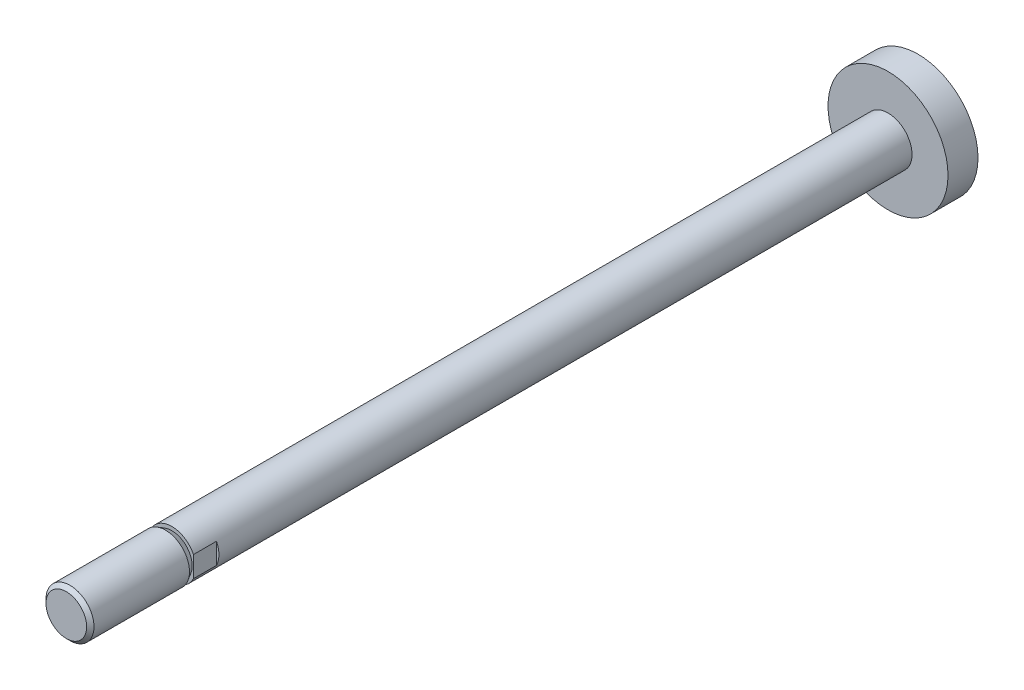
ISO-10303-21;
HEADER;
FILE_DESCRIPTION(('STEP AP214'),'2;1');
FILE_NAME('part.step','',(''),(''),'','','');
FILE_SCHEMA(('AUTOMOTIVE_DESIGN { 1 0 10303 214 1 1 1 1 }'));
ENDSEC;
DATA;
#1=APPLICATION_CONTEXT('core data for automotive mechanical design processes');
#2=APPLICATION_PROTOCOL_DEFINITION('international standard','automotive_design',2000,#1);
#3=PRODUCT_CONTEXT('',#1,'mechanical');
#4=PRODUCT('Part','Part','',(#3));
#5=PRODUCT_RELATED_PRODUCT_CATEGORY('part','',(#4));
#6=PRODUCT_DEFINITION_FORMATION('','',#4);
#7=PRODUCT_DEFINITION_CONTEXT('part definition',#1,'design');
#8=PRODUCT_DEFINITION('design','',#6,#7);
#9=PRODUCT_DEFINITION_SHAPE('','',#8);
#10=(LENGTH_UNIT() NAMED_UNIT(*) SI_UNIT(.MILLI.,.METRE.));
#11=(NAMED_UNIT(*) PLANE_ANGLE_UNIT() SI_UNIT($,.RADIAN.));
#12=(NAMED_UNIT(*) SI_UNIT($,.STERADIAN.) SOLID_ANGLE_UNIT());
#13=UNCERTAINTY_MEASURE_WITH_UNIT(LENGTH_MEASURE(1.E-05),#10,'distance_accuracy_value','');
#14=(GEOMETRIC_REPRESENTATION_CONTEXT(3) GLOBAL_UNCERTAINTY_ASSIGNED_CONTEXT((#13)) GLOBAL_UNIT_ASSIGNED_CONTEXT((#10,
#11,#12)) REPRESENTATION_CONTEXT('',''));
#15=CARTESIAN_POINT('',(0.,0.,0.));
#16=DIRECTION('',(0.,0.,1.));
#17=DIRECTION('',(1.,0.,0.));
#18=AXIS2_PLACEMENT_3D('',#15,#16,#17);
#19=CARTESIAN_POINT('',(0.,2.1165,50.));
#20=DIRECTION('',(0.,0.,1.));
#21=DIRECTION('',(1.,0.,0.));
#22=AXIS2_PLACEMENT_3D('',#19,#20,#21);
#23=PLANE('',#22);
#24=CARTESIAN_POINT('',(0.,0.,49.9999999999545));
#25=DIRECTION('',(0.,0.,-1.));
#26=DIRECTION('',(-1.,0.,0.));
#27=AXIS2_PLACEMENT_3D('',#24,#25,#26);
#28=CIRCLE('',#27,4.23300000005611);
#29=CARTESIAN_POINT('',(-4.23300000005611,0.,49.9999999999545));
#30=VERTEX_POINT('',#29);
#31=EDGE_CURVE('E21',#30,#30,#28,.T.);
#32=ORIENTED_EDGE('',*,*,#31,.F.);
#33=EDGE_LOOP('',(#32));
#34=FACE_BOUND('',#33,.T.);
#35=ADVANCED_FACE('F17',(#34),#23,.T.);
#36=CARTESIAN_POINT('',(0.,0.,49.2330000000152));
#37=DIRECTION('',(0.,0.,-1.));
#38=DIRECTION('',(-1.,0.,0.));
#39=AXIS2_PLACEMENT_3D('',#36,#37,#38);
#40=CONICAL_SURFACE('',#39,4.99999999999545,0.785398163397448);
#41=ORIENTED_EDGE('',*,*,#31,.T.);
#42=EDGE_LOOP('',(#41));
#43=FACE_BOUND('',#42,.T.);
#44=CARTESIAN_POINT('',(0.,0.,49.233));
#45=DIRECTION('',(0.,0.,1.));
#46=DIRECTION('',(1.,0.,0.));
#47=AXIS2_PLACEMENT_3D('',#44,#45,#46);
#48=CIRCLE('',#47,5.);
#49=CARTESIAN_POINT('',(5.,0.,49.233));
#50=VERTEX_POINT('',#49);
#51=EDGE_CURVE('E104',#50,#50,#48,.F.);
#52=ORIENTED_EDGE('',*,*,#51,.F.);
#53=EDGE_LOOP('',(#52));
#54=FACE_BOUND('',#53,.T.);
#55=ADVANCED_FACE('F197',(#43,#54),#40,.T.);
#56=CARTESIAN_POINT('',(0.,0.,39.2807414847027));
#57=DIRECTION('',(0.,0.,1.));
#58=DIRECTION('',(1.,0.,0.));
#59=AXIS2_PLACEMENT_3D('',#56,#57,#58);
#60=CYLINDRICAL_SURFACE('',#59,5.);
#61=ORIENTED_EDGE('',*,*,#51,.T.);
#62=EDGE_LOOP('',(#61));
#63=FACE_BOUND('',#62,.T.);
#64=CARTESIAN_POINT('',(0.,0.,29.328482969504));
#65=DIRECTION('',(0.,0.,1.));
#66=DIRECTION('',(0.,1.,0.));
#67=AXIS2_PLACEMENT_3D('',#64,#65,#66);
#68=CIRCLE('',#67,4.99999999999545);
#69=CARTESIAN_POINT('',(0.,4.99999999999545,29.328482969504));
#70=VERTEX_POINT('',#69);
#71=EDGE_CURVE('E64',#70,#70,#68,.F.);
#72=ORIENTED_EDGE('',*,*,#71,.F.);
#73=EDGE_LOOP('',(#72));
#74=FACE_BOUND('',#73,.T.);
#75=ADVANCED_FACE('F189',(#63,#74),#60,.T.);
#76=CARTESIAN_POINT('',(0.,6.25,-127.5));
#77=DIRECTION('',(0.,0.,-1.));
#78=DIRECTION('',(-1.,0.,0.));
#79=AXIS2_PLACEMENT_3D('',#76,#77,#78);
#80=PLANE('',#79);
#81=CARTESIAN_POINT('',(0.,0.,-127.5));
#82=DIRECTION('',(0.,0.,1.));
#83=DIRECTION('',(1.,0.,0.));
#84=AXIS2_PLACEMENT_3D('',#81,#82,#83);
#85=CIRCLE('',#84,12.5);
#86=CARTESIAN_POINT('',(12.5,0.,-127.5));
#87=VERTEX_POINT('',#86);
#88=EDGE_CURVE('E63',#87,#87,#85,.T.);
#89=ORIENTED_EDGE('',*,*,#88,.F.);
#90=EDGE_LOOP('',(#89));
#91=FACE_BOUND('',#90,.T.);
#92=ADVANCED_FACE('F181',(#91),#80,.T.);
#93=CARTESIAN_POINT('',(0.,0.,29.3284829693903));
#94=DIRECTION('',(0.,0.,1.));
#95=DIRECTION('',(1.,0.,0.));
#96=AXIS2_PLACEMENT_3D('',#93,#94,#95);
#97=CONICAL_SURFACE('',#96,4.99999999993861,0.523598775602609);
#98=ORIENTED_EDGE('',*,*,#71,.T.);
#99=EDGE_LOOP('',(#98));
#100=FACE_BOUND('',#99,.T.);
#101=CARTESIAN_POINT('',(0.,0.,27.9999999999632));
#102=DIRECTION('',(0.,0.,1.));
#103=DIRECTION('',(1.,0.,0.));
#104=AXIS2_PLACEMENT_3D('',#101,#102,#103);
#105=CIRCLE('',#104,4.2329999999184);
#106=CARTESIAN_POINT('',(4.2329999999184,0.,27.9999999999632));
#107=VERTEX_POINT('',#106);
#108=EDGE_CURVE('E80',#107,#107,#105,.F.);
#109=ORIENTED_EDGE('',*,*,#108,.F.);
#110=EDGE_LOOP('',(#109));
#111=FACE_BOUND('',#110,.T.);
#112=ADVANCED_FACE('F174',(#100,#111),#97,.T.);
#113=CARTESIAN_POINT('',(-4.5,22.,23.2));
#114=DIRECTION('',(0.,0.,-1.));
#115=DIRECTION('',(-1.,0.,0.));
#116=AXIS2_PLACEMENT_3D('',#113,#114,#115);
#117=PLANE('',#116);
#118=DIRECTION('',(0.,1.,0.));
#119=VECTOR('',#118,1.);
#120=CARTESIAN_POINT('',(-4.5,22.,23.2));
#121=LINE('',#120,#119);
#122=CARTESIAN_POINT('',(-4.5,-2.17944947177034,23.2));
#123=VERTEX_POINT('',#122);
#124=CARTESIAN_POINT('',(-4.5,2.17944947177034,23.2));
#125=VERTEX_POINT('',#124);
#126=EDGE_CURVE('E55',#123,#125,#121,.T.);
#127=ORIENTED_EDGE('',*,*,#126,.T.);
#128=CARTESIAN_POINT('',(0.,0.,23.2));
#129=DIRECTION('',(0.,0.,1.));
#130=DIRECTION('',(1.,0.,0.));
#131=AXIS2_PLACEMENT_3D('',#128,#129,#130);
#132=CIRCLE('',#131,5.);
#133=EDGE_CURVE('E59',#123,#125,#132,.F.);
#134=ORIENTED_EDGE('',*,*,#133,.F.);
#135=EDGE_LOOP('',(#127,#134));
#136=FACE_BOUND('',#135,.T.);
#137=ADVANCED_FACE('F57',(#136),#117,.F.);
#138=CARTESIAN_POINT('',(-4.5,22.,28.));
#139=DIRECTION('',(1.,0.,0.));
#140=DIRECTION('',(0.,0.,-1.));
#141=AXIS2_PLACEMENT_3D('',#138,#139,#140);
#142=PLANE('',#141);
#143=DIRECTION('',(0.,1.,0.));
#144=VECTOR('',#143,1.);
#145=CARTESIAN_POINT('',(-4.5,4.6165,28.));
#146=LINE('',#145,#144);
#147=CARTESIAN_POINT('',(-4.5,2.17944947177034,28.));
#148=VERTEX_POINT('',#147);
#149=CARTESIAN_POINT('',(-4.5,-2.17944947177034,28.));
#150=VERTEX_POINT('',#149);
#151=EDGE_CURVE('E71',#148,#150,#146,.F.);
#152=ORIENTED_EDGE('',*,*,#151,.F.);
#153=DIRECTION('',(0.,0.,1.));
#154=VECTOR('',#153,1.);
#155=CARTESIAN_POINT('',(-4.5,2.17944947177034,-46.625));
#156=LINE('',#155,#154);
#157=EDGE_CURVE('E68',#125,#148,#156,.T.);
#158=ORIENTED_EDGE('',*,*,#157,.F.);
#159=ORIENTED_EDGE('',*,*,#126,.F.);
#160=DIRECTION('',(0.,0.,1.));
#161=VECTOR('',#160,1.);
#162=CARTESIAN_POINT('',(-4.5,-2.17944947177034,-46.625));
#163=LINE('',#162,#161);
#164=EDGE_CURVE('E78',#150,#123,#163,.F.);
#165=ORIENTED_EDGE('',*,*,#164,.F.);
#166=EDGE_LOOP('',(#152,#158,#159,#165));
#167=FACE_BOUND('',#166,.T.);
#168=ADVANCED_FACE('F69',(#167),#142,.F.);
#169=CARTESIAN_POINT('',(0.,0.,-124.375));
#170=DIRECTION('',(0.,0.,1.));
#171=DIRECTION('',(1.,0.,0.));
#172=AXIS2_PLACEMENT_3D('',#169,#170,#171);
#173=CYLINDRICAL_SURFACE('',#172,12.5);
#174=CARTESIAN_POINT('',(0.,0.,-121.25));
#175=DIRECTION('',(0.,0.,1.));
#176=DIRECTION('',(1.,0.,0.));
#177=AXIS2_PLACEMENT_3D('',#174,#175,#176);
#178=CIRCLE('',#177,12.5);
#179=CARTESIAN_POINT('',(12.5,0.,-121.25));
#180=VERTEX_POINT('',#179);
#181=EDGE_CURVE('E74',#180,#180,#178,.T.);
#182=ORIENTED_EDGE('',*,*,#181,.F.);
#183=EDGE_LOOP('',(#182));
#184=FACE_BOUND('',#183,.T.);
#185=ORIENTED_EDGE('',*,*,#88,.T.);
#186=EDGE_LOOP('',(#185));
#187=FACE_BOUND('',#186,.T.);
#188=ADVANCED_FACE('F115',(#184,#187),#173,.T.);
#189=CARTESIAN_POINT('',(15.5,22.,23.2));
#190=DIRECTION('',(0.,0.,-1.));
#191=DIRECTION('',(-1.,0.,0.));
#192=AXIS2_PLACEMENT_3D('',#189,#190,#191);
#193=PLANE('',#192);
#194=DIRECTION('',(0.,1.,0.));
#195=VECTOR('',#194,1.);
#196=CARTESIAN_POINT('',(4.5,22.,23.2));
#197=LINE('',#196,#195);
#198=CARTESIAN_POINT('',(4.5,2.17944947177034,23.2));
#199=VERTEX_POINT('',#198);
#200=CARTESIAN_POINT('',(4.5,-2.17944947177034,23.2));
#201=VERTEX_POINT('',#200);
#202=EDGE_CURVE('E87',#199,#201,#197,.F.);
#203=ORIENTED_EDGE('',*,*,#202,.T.);
#204=CARTESIAN_POINT('',(0.,0.,23.2));
#205=DIRECTION('',(0.,0.,1.));
#206=DIRECTION('',(1.,0.,0.));
#207=AXIS2_PLACEMENT_3D('',#204,#205,#206);
#208=CIRCLE('',#207,5.);
#209=EDGE_CURVE('E99',#199,#201,#208,.F.);
#210=ORIENTED_EDGE('',*,*,#209,.F.);
#211=EDGE_LOOP('',(#203,#210));
#212=FACE_BOUND('',#211,.T.);
#213=ADVANCED_FACE('F117',(#212),#193,.F.);
#214=CARTESIAN_POINT('',(4.5,22.,23.2));
#215=DIRECTION('',(-1.,0.,0.));
#216=DIRECTION('',(0.,0.,1.));
#217=AXIS2_PLACEMENT_3D('',#214,#215,#216);
#218=PLANE('',#217);
#219=ORIENTED_EDGE('',*,*,#202,.F.);
#220=DIRECTION('',(0.,0.,1.));
#221=VECTOR('',#220,1.);
#222=CARTESIAN_POINT('',(4.5,2.17944947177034,-46.625));
#223=LINE('',#222,#221);
#224=CARTESIAN_POINT('',(4.5,2.17944947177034,28.));
#225=VERTEX_POINT('',#224);
#226=EDGE_CURVE('E97',#225,#199,#223,.F.);
#227=ORIENTED_EDGE('',*,*,#226,.F.);
#228=DIRECTION('',(0.,1.,0.));
#229=VECTOR('',#228,1.);
#230=CARTESIAN_POINT('',(4.5,4.6165,28.));
#231=LINE('',#230,#229);
#232=CARTESIAN_POINT('',(4.5,-2.17944947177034,28.));
#233=VERTEX_POINT('',#232);
#234=EDGE_CURVE('E36',#233,#225,#231,.T.);
#235=ORIENTED_EDGE('',*,*,#234,.F.);
#236=DIRECTION('',(0.,0.,1.));
#237=VECTOR('',#236,1.);
#238=CARTESIAN_POINT('',(4.5,-2.17944947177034,-46.625));
#239=LINE('',#238,#237);
#240=EDGE_CURVE('E96',#201,#233,#239,.T.);
#241=ORIENTED_EDGE('',*,*,#240,.F.);
#242=EDGE_LOOP('',(#219,#227,#235,#241));
#243=FACE_BOUND('',#242,.T.);
#244=ADVANCED_FACE('F124',(#243),#218,.F.);
#245=CARTESIAN_POINT('',(0.,4.6165,28.));
#246=DIRECTION('',(0.,0.,1.));
#247=DIRECTION('',(1.,0.,0.));
#248=AXIS2_PLACEMENT_3D('',#245,#246,#247);
#249=PLANE('',#248);
#250=ORIENTED_EDGE('',*,*,#108,.T.);
#251=EDGE_LOOP('',(#250));
#252=FACE_BOUND('',#251,.T.);
#253=CARTESIAN_POINT('',(0.,0.,28.));
#254=DIRECTION('',(0.,0.,1.));
#255=DIRECTION('',(1.,0.,0.));
#256=AXIS2_PLACEMENT_3D('',#253,#254,#255);
#257=CIRCLE('',#256,5.);
#258=EDGE_CURVE('E100',#148,#225,#257,.F.);
#259=ORIENTED_EDGE('',*,*,#258,.F.);
#260=ORIENTED_EDGE('',*,*,#151,.T.);
#261=CARTESIAN_POINT('',(0.,0.,28.));
#262=DIRECTION('',(0.,0.,1.));
#263=DIRECTION('',(1.,0.,0.));
#264=AXIS2_PLACEMENT_3D('',#261,#262,#263);
#265=CIRCLE('',#264,5.);
#266=EDGE_CURVE('E27',#233,#150,#265,.F.);
#267=ORIENTED_EDGE('',*,*,#266,.F.);
#268=ORIENTED_EDGE('',*,*,#234,.T.);
#269=EDGE_LOOP('',(#259,#260,#267,#268));
#270=FACE_BOUND('',#269,.T.);
#271=ADVANCED_FACE('F131',(#252,#270),#249,.T.);
#272=CARTESIAN_POINT('',(0.,8.75,-121.25));
#273=DIRECTION('',(0.,0.,1.));
#274=DIRECTION('',(1.,0.,0.));
#275=AXIS2_PLACEMENT_3D('',#272,#273,#274);
#276=PLANE('',#275);
#277=ORIENTED_EDGE('',*,*,#181,.T.);
#278=EDGE_LOOP('',(#277));
#279=FACE_BOUND('',#278,.T.);
#280=CARTESIAN_POINT('',(0.,0.,-121.25));
#281=DIRECTION('',(0.,0.,1.));
#282=DIRECTION('',(1.,0.,0.));
#283=AXIS2_PLACEMENT_3D('',#280,#281,#282);
#284=CIRCLE('',#283,5.);
#285=CARTESIAN_POINT('',(5.,0.,-121.25));
#286=VERTEX_POINT('',#285);
#287=EDGE_CURVE('E11',#286,#286,#284,.T.);
#288=ORIENTED_EDGE('',*,*,#287,.F.);
#289=EDGE_LOOP('',(#288));
#290=FACE_BOUND('',#289,.T.);
#291=ADVANCED_FACE('F112',(#279,#290),#276,.T.);
#292=CARTESIAN_POINT('',(0.,0.,-46.625));
#293=DIRECTION('',(0.,0.,1.));
#294=DIRECTION('',(1.,0.,0.));
#295=AXIS2_PLACEMENT_3D('',#292,#293,#294);
#296=CYLINDRICAL_SURFACE('',#295,5.);
#297=ORIENTED_EDGE('',*,*,#157,.T.);
#298=ORIENTED_EDGE('',*,*,#258,.T.);
#299=ORIENTED_EDGE('',*,*,#226,.T.);
#300=ORIENTED_EDGE('',*,*,#209,.T.);
#301=ORIENTED_EDGE('',*,*,#240,.T.);
#302=ORIENTED_EDGE('',*,*,#266,.T.);
#303=ORIENTED_EDGE('',*,*,#164,.T.);
#304=ORIENTED_EDGE('',*,*,#133,.T.);
#305=EDGE_LOOP('',(#297,#298,#299,#300,#301,#302,#303,#304));
#306=FACE_BOUND('',#305,.T.);
#307=ORIENTED_EDGE('',*,*,#287,.T.);
#308=EDGE_LOOP('',(#307));
#309=FACE_BOUND('',#308,.T.);
#310=ADVANCED_FACE('F19',(#306,#309),#296,.T.);
#311=CLOSED_SHELL('',(#35,#55,#75,#92,#112,#137,#168,#188,#213,#244,#271,#291,#310));
#312=MANIFOLD_SOLID_BREP('B1',#311);
#313=ADVANCED_BREP_SHAPE_REPRESENTATION('',(#18,#312),#14);
#314=SHAPE_DEFINITION_REPRESENTATION(#9,#313);
ENDSEC;
END-ISO-10303-21;
